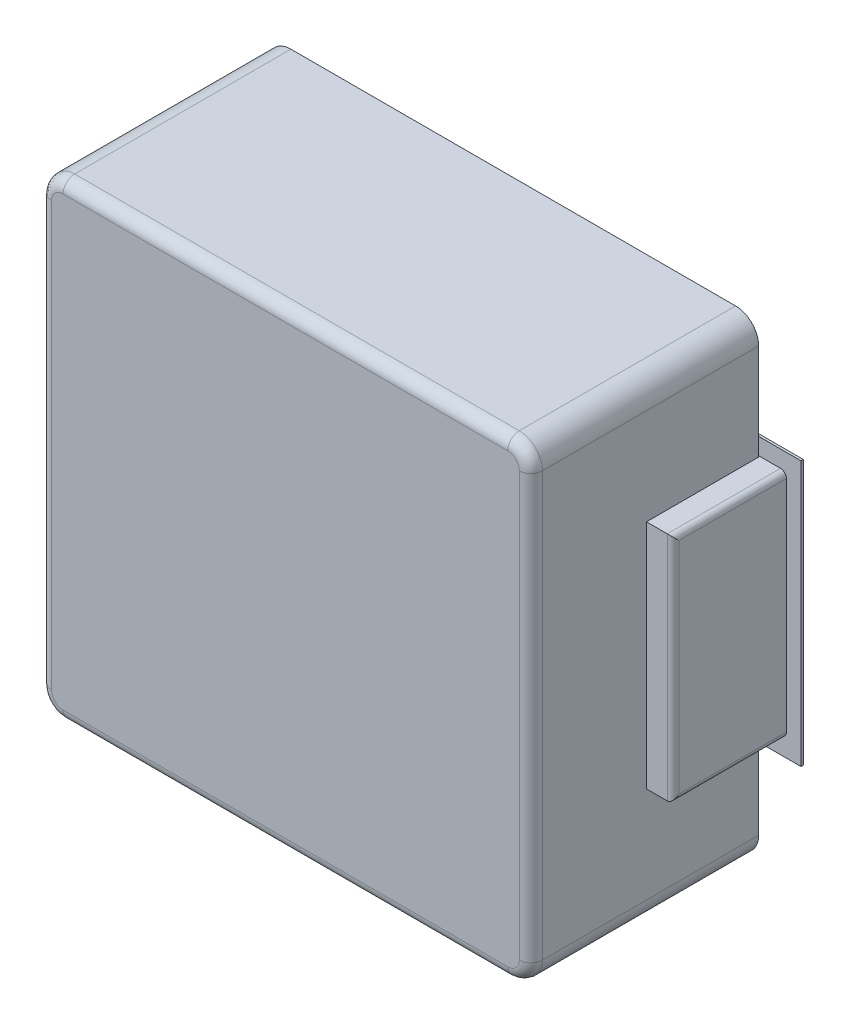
ISO-10303-21;
HEADER;
FILE_DESCRIPTION(('STEP AP214'),'2;1');
FILE_NAME('part.step','',(''),(''),'','','');
FILE_SCHEMA(('AUTOMOTIVE_DESIGN { 1 0 10303 214 1 1 1 1 }'));
ENDSEC;
DATA;
#1=APPLICATION_CONTEXT('core data for automotive mechanical design processes');
#2=APPLICATION_PROTOCOL_DEFINITION('international standard','automotive_design',2000,#1);
#3=PRODUCT_CONTEXT('',#1,'mechanical');
#4=PRODUCT('Part','Part','',(#3));
#5=PRODUCT_RELATED_PRODUCT_CATEGORY('part','',(#4));
#6=PRODUCT_DEFINITION_FORMATION('','',#4);
#7=PRODUCT_DEFINITION_CONTEXT('part definition',#1,'design');
#8=PRODUCT_DEFINITION('design','',#6,#7);
#9=PRODUCT_DEFINITION_SHAPE('','',#8);
#10=(LENGTH_UNIT() NAMED_UNIT(*) SI_UNIT(.MILLI.,.METRE.));
#11=(NAMED_UNIT(*) PLANE_ANGLE_UNIT() SI_UNIT($,.RADIAN.));
#12=(NAMED_UNIT(*) SI_UNIT($,.STERADIAN.) SOLID_ANGLE_UNIT());
#13=UNCERTAINTY_MEASURE_WITH_UNIT(LENGTH_MEASURE(1.E-05),#10,'distance_accuracy_value','');
#14=(GEOMETRIC_REPRESENTATION_CONTEXT(3) GLOBAL_UNCERTAINTY_ASSIGNED_CONTEXT((#13)) GLOBAL_UNIT_ASSIGNED_CONTEXT((#10,
#11,#12)) REPRESENTATION_CONTEXT('',''));
#15=CARTESIAN_POINT('',(0.,0.,0.));
#16=DIRECTION('',(0.,0.,1.));
#17=DIRECTION('',(1.,0.,0.));
#18=AXIS2_PLACEMENT_3D('',#15,#16,#17);
#19=CARTESIAN_POINT('',(0.,0.,0.0762));
#20=DIRECTION('',(0.,0.,1.));
#21=DIRECTION('',(1.,0.,0.));
#22=AXIS2_PLACEMENT_3D('',#19,#20,#21);
#23=PLANE('',#22);
#24=DIRECTION('',(1.,0.,0.));
#25=VECTOR('',#24,1.);
#26=CARTESIAN_POINT('',(-2.47799999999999,-1.14499999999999,0.0762));
#27=LINE('',#26,#25);
#28=CARTESIAN_POINT('',(-2.47799999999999,-1.14499999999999,0.0762));
#29=VERTEX_POINT('',#28);
#30=CARTESIAN_POINT('',(-1.07800000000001,-1.14499999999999,0.0762));
#31=VERTEX_POINT('',#30);
#32=EDGE_CURVE('E350',#29,#31,#27,.T.);
#33=ORIENTED_EDGE('',*,*,#32,.F.);
#34=DIRECTION('',(0.,1.,0.));
#35=VECTOR('',#34,1.);
#36=CARTESIAN_POINT('',(-2.47799999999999,1.14499999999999,0.0762));
#37=LINE('',#36,#35);
#38=CARTESIAN_POINT('',(-2.47799999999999,1.14499999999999,0.0762));
#39=VERTEX_POINT('',#38);
#40=EDGE_CURVE('E355',#39,#29,#37,.F.);
#41=ORIENTED_EDGE('',*,*,#40,.F.);
#42=DIRECTION('',(1.,0.,0.));
#43=VECTOR('',#42,1.);
#44=CARTESIAN_POINT('',(0.,1.14499999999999,0.0762));
#45=LINE('',#44,#43);
#46=CARTESIAN_POINT('',(-1.07800000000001,1.14499999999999,0.0762));
#47=VERTEX_POINT('',#46);
#48=EDGE_CURVE('E359',#47,#39,#45,.F.);
#49=ORIENTED_EDGE('',*,*,#48,.F.);
#50=DIRECTION('',(0.,1.,0.));
#51=VECTOR('',#50,1.);
#52=CARTESIAN_POINT('',(-1.07800000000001,-1.14499999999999,0.0762));
#53=LINE('',#52,#51);
#54=EDGE_CURVE('E344',#31,#47,#53,.T.);
#55=ORIENTED_EDGE('',*,*,#54,.F.);
#56=EDGE_LOOP('',(#33,#41,#49,#55));
#57=FACE_BOUND('',#56,.T.);
#58=ADVANCED_FACE('F16',(#57),#23,.F.);
#59=CARTESIAN_POINT('',(0.,0.,0.0762));
#60=DIRECTION('',(0.,0.,1.));
#61=DIRECTION('',(1.,0.,0.));
#62=AXIS2_PLACEMENT_3D('',#59,#60,#61);
#63=PLANE('',#62);
#64=DIRECTION('',(1.,0.,0.));
#65=VECTOR('',#64,1.);
#66=CARTESIAN_POINT('',(1.07800000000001,-1.14499999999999,0.0762));
#67=LINE('',#66,#65);
#68=CARTESIAN_POINT('',(1.07800000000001,-1.14499999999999,0.0762));
#69=VERTEX_POINT('',#68);
#70=CARTESIAN_POINT('',(2.47799999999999,-1.14499999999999,0.0762));
#71=VERTEX_POINT('',#70);
#72=EDGE_CURVE('E331',#69,#71,#67,.T.);
#73=ORIENTED_EDGE('',*,*,#72,.F.);
#74=DIRECTION('',(0.,1.,0.));
#75=VECTOR('',#74,1.);
#76=CARTESIAN_POINT('',(1.07800000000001,1.14499999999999,0.0762));
#77=LINE('',#76,#75);
#78=CARTESIAN_POINT('',(1.07800000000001,1.14499999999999,0.0762));
#79=VERTEX_POINT('',#78);
#80=EDGE_CURVE('E336',#79,#69,#77,.F.);
#81=ORIENTED_EDGE('',*,*,#80,.F.);
#82=DIRECTION('',(1.,0.,0.));
#83=VECTOR('',#82,1.);
#84=CARTESIAN_POINT('',(0.,1.14499999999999,0.0762));
#85=LINE('',#84,#83);
#86=CARTESIAN_POINT('',(2.47799999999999,1.14499999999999,0.0762));
#87=VERTEX_POINT('',#86);
#88=EDGE_CURVE('E357',#87,#79,#85,.F.);
#89=ORIENTED_EDGE('',*,*,#88,.F.);
#90=DIRECTION('',(0.,1.,0.));
#91=VECTOR('',#90,1.);
#92=CARTESIAN_POINT('',(2.47799999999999,-1.14499999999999,0.0762));
#93=LINE('',#92,#91);
#94=EDGE_CURVE('E325',#71,#87,#93,.T.);
#95=ORIENTED_EDGE('',*,*,#94,.F.);
#96=EDGE_LOOP('',(#73,#81,#89,#95));
#97=FACE_BOUND('',#96,.T.);
#98=ADVANCED_FACE('F927',(#97),#63,.F.);
#99=CARTESIAN_POINT('',(-2.47799999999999,1.14499999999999,0.0762));
#100=DIRECTION('',(-1.,0.,0.));
#101=DIRECTION('',(0.,0.,1.));
#102=AXIS2_PLACEMENT_3D('',#99,#100,#101);
#103=PLANE('',#102);
#104=DIRECTION('',(0.,0.,1.));
#105=VECTOR('',#104,1.);
#106=CARTESIAN_POINT('',(-2.47799999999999,1.14499999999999,0.0762));
#107=LINE('',#106,#105);
#108=CARTESIAN_POINT('',(-2.47799999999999,1.14499999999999,0.0961999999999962));
#109=VERTEX_POINT('',#108);
#110=EDGE_CURVE('E341',#39,#109,#107,.T.);
#111=ORIENTED_EDGE('',*,*,#110,.F.);
#112=ORIENTED_EDGE('',*,*,#40,.T.);
#113=DIRECTION('',(0.,0.,-1.));
#114=VECTOR('',#113,1.);
#115=CARTESIAN_POINT('',(-2.47799999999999,-1.14499999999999,0.0762));
#116=LINE('',#115,#114);
#117=CARTESIAN_POINT('',(-2.47799999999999,-1.14499999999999,0.0961999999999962));
#118=VERTEX_POINT('',#117);
#119=EDGE_CURVE('E352',#118,#29,#116,.T.);
#120=ORIENTED_EDGE('',*,*,#119,.F.);
#121=DIRECTION('',(0.,1.,0.));
#122=VECTOR('',#121,1.);
#123=CARTESIAN_POINT('',(-2.47799999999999,0.,0.0961999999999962));
#124=LINE('',#123,#122);
#125=EDGE_CURVE('E313',#109,#118,#124,.F.);
#126=ORIENTED_EDGE('',*,*,#125,.F.);
#127=EDGE_LOOP('',(#111,#112,#120,#126));
#128=FACE_BOUND('',#127,.T.);
#129=ADVANCED_FACE('F924',(#128),#103,.T.);
#130=CARTESIAN_POINT('',(-2.47799999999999,-1.14499999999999,0.0762));
#131=DIRECTION('',(0.,-1.,0.));
#132=DIRECTION('',(0.,0.,-1.));
#133=AXIS2_PLACEMENT_3D('',#130,#131,#132);
#134=PLANE('',#133);
#135=ORIENTED_EDGE('',*,*,#119,.T.);
#136=ORIENTED_EDGE('',*,*,#32,.T.);
#137=DIRECTION('',(0.,0.,-1.));
#138=VECTOR('',#137,1.);
#139=CARTESIAN_POINT('',(-1.07800000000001,-1.14499999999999,0.0762));
#140=LINE('',#139,#138);
#141=CARTESIAN_POINT('',(-1.07800000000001,-1.14499999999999,0.0961999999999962));
#142=VERTEX_POINT('',#141);
#143=EDGE_CURVE('E347',#142,#31,#140,.T.);
#144=ORIENTED_EDGE('',*,*,#143,.F.);
#145=DIRECTION('',(1.,0.,0.));
#146=VECTOR('',#145,1.);
#147=CARTESIAN_POINT('',(0.,-1.14499999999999,0.0961999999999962));
#148=LINE('',#147,#146);
#149=EDGE_CURVE('E310',#118,#142,#148,.T.);
#150=ORIENTED_EDGE('',*,*,#149,.F.);
#151=EDGE_LOOP('',(#135,#136,#144,#150));
#152=FACE_BOUND('',#151,.T.);
#153=ADVANCED_FACE('F920',(#152),#134,.T.);
#154=CARTESIAN_POINT('',(-1.07800000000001,-1.14499999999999,0.0762));
#155=DIRECTION('',(1.,0.,0.));
#156=DIRECTION('',(0.,0.,-1.));
#157=AXIS2_PLACEMENT_3D('',#154,#155,#156);
#158=PLANE('',#157);
#159=ORIENTED_EDGE('',*,*,#143,.T.);
#160=ORIENTED_EDGE('',*,*,#54,.T.);
#161=DIRECTION('',(0.,0.,1.));
#162=VECTOR('',#161,1.);
#163=CARTESIAN_POINT('',(-1.07800000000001,1.14499999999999,0.0762));
#164=LINE('',#163,#162);
#165=CARTESIAN_POINT('',(-1.07800000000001,1.14499999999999,0.0961999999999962));
#166=VERTEX_POINT('',#165);
#167=EDGE_CURVE('E338',#166,#47,#164,.F.);
#168=ORIENTED_EDGE('',*,*,#167,.F.);
#169=DIRECTION('',(0.,1.,0.));
#170=VECTOR('',#169,1.);
#171=CARTESIAN_POINT('',(-1.07800000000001,0.,0.0961999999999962));
#172=LINE('',#171,#170);
#173=EDGE_CURVE('E307',#142,#166,#172,.T.);
#174=ORIENTED_EDGE('',*,*,#173,.F.);
#175=EDGE_LOOP('',(#159,#160,#168,#174));
#176=FACE_BOUND('',#175,.T.);
#177=ADVANCED_FACE('F916',(#176),#158,.T.);
#178=CARTESIAN_POINT('',(-1.07800000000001,1.14499999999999,0.0762));
#179=DIRECTION('',(0.,1.,0.));
#180=DIRECTION('',(0.,0.,1.));
#181=AXIS2_PLACEMENT_3D('',#178,#179,#180);
#182=PLANE('',#181);
#183=ORIENTED_EDGE('',*,*,#167,.T.);
#184=ORIENTED_EDGE('',*,*,#48,.T.);
#185=ORIENTED_EDGE('',*,*,#110,.T.);
#186=DIRECTION('',(1.,0.,0.));
#187=VECTOR('',#186,1.);
#188=CARTESIAN_POINT('',(0.,1.14499999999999,0.0961999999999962));
#189=LINE('',#188,#187);
#190=EDGE_CURVE('E302',#166,#109,#189,.F.);
#191=ORIENTED_EDGE('',*,*,#190,.F.);
#192=EDGE_LOOP('',(#183,#184,#185,#191));
#193=FACE_BOUND('',#192,.T.);
#194=ADVANCED_FACE('F912',(#193),#182,.T.);
#195=CARTESIAN_POINT('',(1.07800000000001,1.14499999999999,0.0762));
#196=DIRECTION('',(-1.,0.,0.));
#197=DIRECTION('',(0.,0.,1.));
#198=AXIS2_PLACEMENT_3D('',#195,#196,#197);
#199=PLANE('',#198);
#200=DIRECTION('',(0.,0.,1.));
#201=VECTOR('',#200,1.);
#202=CARTESIAN_POINT('',(1.07800000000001,1.14499999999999,0.0762));
#203=LINE('',#202,#201);
#204=CARTESIAN_POINT('',(1.07800000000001,1.14499999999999,0.0961999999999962));
#205=VERTEX_POINT('',#204);
#206=EDGE_CURVE('E322',#79,#205,#203,.T.);
#207=ORIENTED_EDGE('',*,*,#206,.F.);
#208=ORIENTED_EDGE('',*,*,#80,.T.);
#209=DIRECTION('',(0.,0.,-1.));
#210=VECTOR('',#209,1.);
#211=CARTESIAN_POINT('',(1.07800000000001,-1.14499999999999,0.0762));
#212=LINE('',#211,#210);
#213=CARTESIAN_POINT('',(1.07800000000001,-1.14499999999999,0.0961999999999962));
#214=VERTEX_POINT('',#213);
#215=EDGE_CURVE('E333',#214,#69,#212,.T.);
#216=ORIENTED_EDGE('',*,*,#215,.F.);
#217=DIRECTION('',(0.,1.,0.));
#218=VECTOR('',#217,1.);
#219=CARTESIAN_POINT('',(1.07800000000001,0.,0.0961999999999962));
#220=LINE('',#219,#218);
#221=EDGE_CURVE('E290',#205,#214,#220,.F.);
#222=ORIENTED_EDGE('',*,*,#221,.F.);
#223=EDGE_LOOP('',(#207,#208,#216,#222));
#224=FACE_BOUND('',#223,.T.);
#225=ADVANCED_FACE('F908',(#224),#199,.T.);
#226=CARTESIAN_POINT('',(1.07800000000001,-1.14499999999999,0.0762));
#227=DIRECTION('',(0.,-1.,0.));
#228=DIRECTION('',(0.,0.,-1.));
#229=AXIS2_PLACEMENT_3D('',#226,#227,#228);
#230=PLANE('',#229);
#231=ORIENTED_EDGE('',*,*,#215,.T.);
#232=ORIENTED_EDGE('',*,*,#72,.T.);
#233=DIRECTION('',(0.,0.,-1.));
#234=VECTOR('',#233,1.);
#235=CARTESIAN_POINT('',(2.47799999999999,-1.14499999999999,0.0762));
#236=LINE('',#235,#234);
#237=CARTESIAN_POINT('',(2.47799999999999,-1.14499999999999,0.0961999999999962));
#238=VERTEX_POINT('',#237);
#239=EDGE_CURVE('E328',#238,#71,#236,.T.);
#240=ORIENTED_EDGE('',*,*,#239,.F.);
#241=DIRECTION('',(1.,0.,0.));
#242=VECTOR('',#241,1.);
#243=CARTESIAN_POINT('',(0.,-1.14499999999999,0.0961999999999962));
#244=LINE('',#243,#242);
#245=EDGE_CURVE('E287',#214,#238,#244,.T.);
#246=ORIENTED_EDGE('',*,*,#245,.F.);
#247=EDGE_LOOP('',(#231,#232,#240,#246));
#248=FACE_BOUND('',#247,.T.);
#249=ADVANCED_FACE('F904',(#248),#230,.T.);
#250=CARTESIAN_POINT('',(2.47799999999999,-1.14499999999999,0.0762));
#251=DIRECTION('',(1.,0.,0.));
#252=DIRECTION('',(0.,0.,-1.));
#253=AXIS2_PLACEMENT_3D('',#250,#251,#252);
#254=PLANE('',#253);
#255=ORIENTED_EDGE('',*,*,#239,.T.);
#256=ORIENTED_EDGE('',*,*,#94,.T.);
#257=DIRECTION('',(0.,0.,1.));
#258=VECTOR('',#257,1.);
#259=CARTESIAN_POINT('',(2.47799999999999,1.14499999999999,0.0762));
#260=LINE('',#259,#258);
#261=CARTESIAN_POINT('',(2.47799999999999,1.14499999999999,0.0961999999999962));
#262=VERTEX_POINT('',#261);
#263=EDGE_CURVE('E319',#262,#87,#260,.F.);
#264=ORIENTED_EDGE('',*,*,#263,.F.);
#265=DIRECTION('',(0.,1.,0.));
#266=VECTOR('',#265,1.);
#267=CARTESIAN_POINT('',(2.47799999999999,0.,0.0961999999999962));
#268=LINE('',#267,#266);
#269=EDGE_CURVE('E284',#238,#262,#268,.T.);
#270=ORIENTED_EDGE('',*,*,#269,.F.);
#271=EDGE_LOOP('',(#255,#256,#264,#270));
#272=FACE_BOUND('',#271,.T.);
#273=ADVANCED_FACE('F900',(#272),#254,.T.);
#274=CARTESIAN_POINT('',(2.47799999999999,1.14499999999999,0.0762));
#275=DIRECTION('',(0.,1.,0.));
#276=DIRECTION('',(0.,0.,1.));
#277=AXIS2_PLACEMENT_3D('',#274,#275,#276);
#278=PLANE('',#277);
#279=ORIENTED_EDGE('',*,*,#263,.T.);
#280=ORIENTED_EDGE('',*,*,#88,.T.);
#281=ORIENTED_EDGE('',*,*,#206,.T.);
#282=DIRECTION('',(1.,0.,0.));
#283=VECTOR('',#282,1.);
#284=CARTESIAN_POINT('',(0.,1.14499999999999,0.0961999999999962));
#285=LINE('',#284,#283);
#286=EDGE_CURVE('E257',#262,#205,#285,.F.);
#287=ORIENTED_EDGE('',*,*,#286,.F.);
#288=EDGE_LOOP('',(#279,#280,#281,#287));
#289=FACE_BOUND('',#288,.T.);
#290=ADVANCED_FACE('F897',(#289),#278,.T.);
#291=CARTESIAN_POINT('',(2.35199999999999,-1.00000000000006,0.0762));
#292=DIRECTION('',(1.,0.,0.));
#293=DIRECTION('',(0.,0.,-1.));
#294=AXIS2_PLACEMENT_3D('',#291,#292,#293);
#295=PLANE('',#294);
#296=DIRECTION('',(0.,0.,-1.));
#297=VECTOR('',#296,1.);
#298=CARTESIAN_POINT('',(2.35199999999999,-0.95000000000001,0.0762));
#299=LINE('',#298,#297);
#300=CARTESIAN_POINT('',(2.35199999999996,-0.95000000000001,1.02620000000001));
#301=VERTEX_POINT('',#300);
#302=CARTESIAN_POINT('',(2.35199999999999,-0.95000000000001,0.0961999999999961));
#303=VERTEX_POINT('',#302);
#304=EDGE_CURVE('E252',#301,#303,#299,.T.);
#305=ORIENTED_EDGE('',*,*,#304,.T.);
#306=DIRECTION('',(0.,1.,0.));
#307=VECTOR('',#306,1.);
#308=CARTESIAN_POINT('',(2.35199999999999,0.,0.0961999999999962));
#309=LINE('',#308,#307);
#310=CARTESIAN_POINT('',(2.35199999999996,0.95000000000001,0.0961999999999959));
#311=VERTEX_POINT('',#310);
#312=EDGE_CURVE('E245',#311,#303,#309,.F.);
#313=ORIENTED_EDGE('',*,*,#312,.F.);
#314=DIRECTION('',(0.,0.,-1.));
#315=VECTOR('',#314,1.);
#316=CARTESIAN_POINT('',(2.35199999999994,0.95000000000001,4.6833907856));
#317=LINE('',#316,#315);
#318=CARTESIAN_POINT('',(2.35199999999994,0.95000000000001,1.02620000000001));
#319=VERTEX_POINT('',#318);
#320=EDGE_CURVE('E250',#319,#311,#317,.T.);
#321=ORIENTED_EDGE('',*,*,#320,.F.);
#322=DIRECTION('',(0.,1.,0.));
#323=VECTOR('',#322,1.);
#324=CARTESIAN_POINT('',(2.35199999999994,-7.7879448,1.02620000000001));
#325=LINE('',#324,#323);
#326=EDGE_CURVE('E405',#301,#319,#325,.T.);
#327=ORIENTED_EDGE('',*,*,#326,.F.);
#328=EDGE_LOOP('',(#305,#313,#321,#327));
#329=FACE_BOUND('',#328,.T.);
#330=ADVANCED_FACE('F247',(#329),#295,.T.);
#331=CARTESIAN_POINT('',(-2.35199999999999,1.00000000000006,0.0762));
#332=DIRECTION('',(-1.,0.,0.));
#333=DIRECTION('',(0.,0.,1.));
#334=AXIS2_PLACEMENT_3D('',#331,#332,#333);
#335=PLANE('',#334);
#336=DIRECTION('',(0.,0.,1.));
#337=VECTOR('',#336,1.);
#338=CARTESIAN_POINT('',(-2.35199999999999,0.95000000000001,0.0762));
#339=LINE('',#338,#337);
#340=CARTESIAN_POINT('',(-2.35199999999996,0.95000000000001,1.02620000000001));
#341=VERTEX_POINT('',#340);
#342=CARTESIAN_POINT('',(-2.35199999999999,0.95000000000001,0.0961999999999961));
#343=VERTEX_POINT('',#342);
#344=EDGE_CURVE('E316',#341,#343,#339,.F.);
#345=ORIENTED_EDGE('',*,*,#344,.T.);
#346=DIRECTION('',(0.,1.,0.));
#347=VECTOR('',#346,1.);
#348=CARTESIAN_POINT('',(-2.35199999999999,0.,0.0961999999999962));
#349=LINE('',#348,#347);
#350=CARTESIAN_POINT('',(-2.35199999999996,-0.95000000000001,0.0961999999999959));
#351=VERTEX_POINT('',#350);
#352=EDGE_CURVE('E293',#351,#343,#349,.T.);
#353=ORIENTED_EDGE('',*,*,#352,.F.);
#354=DIRECTION('',(0.,0.,-1.));
#355=VECTOR('',#354,1.);
#356=CARTESIAN_POINT('',(-2.35199999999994,-0.95000000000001,4.6833907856));
#357=LINE('',#356,#355);
#358=CARTESIAN_POINT('',(-2.35199999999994,-0.95000000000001,1.02620000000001));
#359=VERTEX_POINT('',#358);
#360=EDGE_CURVE('E400',#359,#351,#357,.T.);
#361=ORIENTED_EDGE('',*,*,#360,.F.);
#362=DIRECTION('',(0.,-1.,0.));
#363=VECTOR('',#362,1.);
#364=CARTESIAN_POINT('',(-2.35199999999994,7.7879448,1.02620000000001));
#365=LINE('',#364,#363);
#366=EDGE_CURVE('E393',#341,#359,#365,.T.);
#367=ORIENTED_EDGE('',*,*,#366,.F.);
#368=EDGE_LOOP('',(#345,#353,#361,#367));
#369=FACE_BOUND('',#368,.T.);
#370=ADVANCED_FACE('F890',(#369),#335,.T.);
#371=CARTESIAN_POINT('',(0.,0.,0.0961999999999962));
#372=DIRECTION('',(0.,0.,1.));
#373=DIRECTION('',(1.,0.,0.));
#374=AXIS2_PLACEMENT_3D('',#371,#372,#373);
#375=PLANE('',#374);
#376=CARTESIAN_POINT('',(-2.30199999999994,-0.95000000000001,0.0961999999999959));
#377=DIRECTION('',(0.,0.,-1.));
#378=DIRECTION('',(-1.,0.,0.));
#379=AXIS2_PLACEMENT_3D('',#376,#377,#378);
#380=CIRCLE('',#379,0.0500000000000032);
#381=CARTESIAN_POINT('',(-2.30199999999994,-1.00000000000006,0.0961999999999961));
#382=VERTEX_POINT('',#381);
#383=EDGE_CURVE('E397',#351,#382,#380,.F.);
#384=ORIENTED_EDGE('',*,*,#383,.F.);
#385=ORIENTED_EDGE('',*,*,#352,.T.);
#386=CARTESIAN_POINT('',(-2.30199999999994,0.95000000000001,0.0961999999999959));
#387=DIRECTION('',(0.,0.,-1.));
#388=DIRECTION('',(-1.,0.,0.));
#389=AXIS2_PLACEMENT_3D('',#386,#387,#388);
#390=CIRCLE('',#389,0.0500000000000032);
#391=CARTESIAN_POINT('',(-2.30199999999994,1.00000000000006,0.0961999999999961));
#392=VERTEX_POINT('',#391);
#393=EDGE_CURVE('E386',#392,#343,#390,.F.);
#394=ORIENTED_EDGE('',*,*,#393,.F.);
#395=DIRECTION('',(1.,0.,0.));
#396=VECTOR('',#395,1.);
#397=CARTESIAN_POINT('',(0.,1.00000000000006,0.0961999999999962));
#398=LINE('',#397,#396);
#399=CARTESIAN_POINT('',(-1.59199999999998,1.00000000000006,0.0961999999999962));
#400=VERTEX_POINT('',#399);
#401=EDGE_CURVE('E298',#392,#400,#398,.T.);
#402=ORIENTED_EDGE('',*,*,#401,.T.);
#403=DIRECTION('',(0.,1.,0.));
#404=VECTOR('',#403,1.);
#405=CARTESIAN_POINT('',(-1.59199999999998,-1.00000000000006,0.0961999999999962));
#406=LINE('',#405,#404);
#407=CARTESIAN_POINT('',(-1.59199999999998,-1.00000000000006,0.0961999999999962));
#408=VERTEX_POINT('',#407);
#409=EDGE_CURVE('E389',#408,#400,#406,.T.);
#410=ORIENTED_EDGE('',*,*,#409,.F.);
#411=DIRECTION('',(1.,0.,0.));
#412=VECTOR('',#411,1.);
#413=CARTESIAN_POINT('',(0.,-1.00000000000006,0.0961999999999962));
#414=LINE('',#413,#412);
#415=EDGE_CURVE('E296',#408,#382,#414,.F.);
#416=ORIENTED_EDGE('',*,*,#415,.T.);
#417=EDGE_LOOP('',(#384,#385,#394,#402,#410,#416));
#418=FACE_BOUND('',#417,.T.);
#419=ORIENTED_EDGE('',*,*,#173,.T.);
#420=ORIENTED_EDGE('',*,*,#190,.T.);
#421=ORIENTED_EDGE('',*,*,#125,.T.);
#422=ORIENTED_EDGE('',*,*,#149,.T.);
#423=EDGE_LOOP('',(#419,#420,#421,#422));
#424=FACE_BOUND('',#423,.T.);
#425=ADVANCED_FACE('F887',(#418,#424),#375,.T.);
#426=CARTESIAN_POINT('',(0.,0.,0.0961999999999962));
#427=DIRECTION('',(0.,0.,1.));
#428=DIRECTION('',(1.,0.,0.));
#429=AXIS2_PLACEMENT_3D('',#426,#427,#428);
#430=PLANE('',#429);
#431=DIRECTION('',(0.,1.,0.));
#432=VECTOR('',#431,1.);
#433=CARTESIAN_POINT('',(1.59199999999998,1.00000000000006,0.0961999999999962));
#434=LINE('',#433,#432);
#435=CARTESIAN_POINT('',(1.59199999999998,1.00000000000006,0.0961999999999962));
#436=VERTEX_POINT('',#435);
#437=CARTESIAN_POINT('',(1.59199999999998,-1.00000000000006,0.0961999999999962));
#438=VERTEX_POINT('',#437);
#439=EDGE_CURVE('E419',#436,#438,#434,.F.);
#440=ORIENTED_EDGE('',*,*,#439,.F.);
#441=DIRECTION('',(1.,0.,0.));
#442=VECTOR('',#441,1.);
#443=CARTESIAN_POINT('',(0.,1.00000000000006,0.0961999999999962));
#444=LINE('',#443,#442);
#445=CARTESIAN_POINT('',(2.30199999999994,1.00000000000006,0.0961999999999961));
#446=VERTEX_POINT('',#445);
#447=EDGE_CURVE('E264',#436,#446,#444,.T.);
#448=ORIENTED_EDGE('',*,*,#447,.T.);
#449=CARTESIAN_POINT('',(2.30199999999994,0.95000000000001,0.0961999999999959));
#450=DIRECTION('',(0.,0.,-1.));
#451=DIRECTION('',(-1.,0.,0.));
#452=AXIS2_PLACEMENT_3D('',#449,#450,#451);
#453=CIRCLE('',#452,0.0500000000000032);
#454=EDGE_CURVE('E19',#311,#446,#453,.F.);
#455=ORIENTED_EDGE('',*,*,#454,.F.);
#456=ORIENTED_EDGE('',*,*,#312,.T.);
#457=CARTESIAN_POINT('',(2.30199999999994,-0.95000000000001,0.0961999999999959));
#458=DIRECTION('',(0.,0.,-1.));
#459=DIRECTION('',(-1.,0.,0.));
#460=AXIS2_PLACEMENT_3D('',#457,#458,#459);
#461=CIRCLE('',#460,0.0500000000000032);
#462=CARTESIAN_POINT('',(2.30199999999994,-1.00000000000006,0.0961999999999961));
#463=VERTEX_POINT('',#462);
#464=EDGE_CURVE('E401',#463,#303,#461,.F.);
#465=ORIENTED_EDGE('',*,*,#464,.F.);
#466=DIRECTION('',(1.,0.,0.));
#467=VECTOR('',#466,1.);
#468=CARTESIAN_POINT('',(0.,-1.00000000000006,0.0961999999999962));
#469=LINE('',#468,#467);
#470=EDGE_CURVE('E256',#463,#438,#469,.F.);
#471=ORIENTED_EDGE('',*,*,#470,.T.);
#472=EDGE_LOOP('',(#440,#448,#455,#456,#465,#471));
#473=FACE_BOUND('',#472,.T.);
#474=ORIENTED_EDGE('',*,*,#269,.T.);
#475=ORIENTED_EDGE('',*,*,#286,.T.);
#476=ORIENTED_EDGE('',*,*,#221,.T.);
#477=ORIENTED_EDGE('',*,*,#245,.T.);
#478=EDGE_LOOP('',(#474,#475,#476,#477));
#479=FACE_BOUND('',#478,.T.);
#480=ADVANCED_FACE('F262',(#473,#479),#430,.T.);
#481=CARTESIAN_POINT('',(2.30199999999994,0.95000000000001,4.6833907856));
#482=DIRECTION('',(0.,0.,-1.));
#483=DIRECTION('',(-1.,0.,0.));
#484=AXIS2_PLACEMENT_3D('',#481,#482,#483);
#485=CYLINDRICAL_SURFACE('',#484,0.0500000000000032);
#486=ORIENTED_EDGE('',*,*,#320,.T.);
#487=ORIENTED_EDGE('',*,*,#454,.T.);
#488=DIRECTION('',(0.,0.,1.));
#489=VECTOR('',#488,1.);
#490=CARTESIAN_POINT('',(2.30199999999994,1.00000000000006,0.0762));
#491=LINE('',#490,#489);
#492=CARTESIAN_POINT('',(2.30199999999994,1.00000000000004,1.07620000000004));
#493=VERTEX_POINT('',#492);
#494=EDGE_CURVE('E274',#493,#446,#491,.F.);
#495=ORIENTED_EDGE('',*,*,#494,.F.);
#496=CARTESIAN_POINT('',(2.30199999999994,0.950000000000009,1.02620000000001));
#497=DIRECTION('',(0.,0.707106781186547,-0.707106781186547));
#498=DIRECTION('',(0.,0.707106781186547,0.707106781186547));
#499=AXIS2_PLACEMENT_3D('',#496,#497,#498);
#500=ELLIPSE('',#499,0.0707106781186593,0.0500000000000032);
#501=EDGE_CURVE('E267',#319,#493,#500,.F.);
#502=ORIENTED_EDGE('',*,*,#501,.F.);
#503=EDGE_LOOP('',(#486,#487,#495,#502));
#504=FACE_BOUND('',#503,.T.);
#505=ADVANCED_FACE('F268',(#504),#485,.T.);
#506=CARTESIAN_POINT('',(2.30199999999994,-7.7879448,1.02620000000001));
#507=DIRECTION('',(0.,1.,0.));
#508=DIRECTION('',(0.,0.,1.));
#509=AXIS2_PLACEMENT_3D('',#506,#507,#508);
#510=CYLINDRICAL_SURFACE('',#509,0.0500000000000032);
#511=CARTESIAN_POINT('',(2.30199999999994,-0.95000000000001,1.02620000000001));
#512=DIRECTION('',(0.,-0.707106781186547,-0.707106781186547));
#513=DIRECTION('',(0.,0.707106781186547,-0.707106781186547));
#514=AXIS2_PLACEMENT_3D('',#511,#512,#513);
#515=ELLIPSE('',#514,0.0707106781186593,0.0500000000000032);
#516=CARTESIAN_POINT('',(2.30199999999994,-1.00000000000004,1.07620000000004));
#517=VERTEX_POINT('',#516);
#518=EDGE_CURVE('E403',#301,#517,#515,.T.);
#519=ORIENTED_EDGE('',*,*,#518,.F.);
#520=ORIENTED_EDGE('',*,*,#326,.T.);
#521=ORIENTED_EDGE('',*,*,#501,.T.);
#522=DIRECTION('',(0.,1.,0.));
#523=VECTOR('',#522,1.);
#524=CARTESIAN_POINT('',(2.30199999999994,0.,1.07620000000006));
#525=LINE('',#524,#523);
#526=EDGE_CURVE('E414',#517,#493,#525,.T.);
#527=ORIENTED_EDGE('',*,*,#526,.F.);
#528=EDGE_LOOP('',(#519,#520,#521,#527));
#529=FACE_BOUND('',#528,.T.);
#530=ADVANCED_FACE('F879',(#529),#510,.T.);
#531=CARTESIAN_POINT('',(2.30199999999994,-0.95000000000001,4.6833907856));
#532=DIRECTION('',(0.,0.,-1.));
#533=DIRECTION('',(-1.,0.,0.));
#534=AXIS2_PLACEMENT_3D('',#531,#532,#533);
#535=CYLINDRICAL_SURFACE('',#534,0.0500000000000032);
#536=DIRECTION('',(0.,0.,-1.));
#537=VECTOR('',#536,1.);
#538=CARTESIAN_POINT('',(2.30199999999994,-1.00000000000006,0.0762));
#539=LINE('',#538,#537);
#540=EDGE_CURVE('E410',#463,#517,#539,.F.);
#541=ORIENTED_EDGE('',*,*,#540,.F.);
#542=ORIENTED_EDGE('',*,*,#464,.T.);
#543=ORIENTED_EDGE('',*,*,#304,.F.);
#544=ORIENTED_EDGE('',*,*,#518,.T.);
#545=EDGE_LOOP('',(#541,#542,#543,#544));
#546=FACE_BOUND('',#545,.T.);
#547=ADVANCED_FACE('F875',(#546),#535,.T.);
#548=CARTESIAN_POINT('',(-2.30199999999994,-0.95000000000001,4.6833907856));
#549=DIRECTION('',(0.,0.,-1.));
#550=DIRECTION('',(-1.,0.,0.));
#551=AXIS2_PLACEMENT_3D('',#548,#549,#550);
#552=CYLINDRICAL_SURFACE('',#551,0.0500000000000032);
#553=ORIENTED_EDGE('',*,*,#360,.T.);
#554=ORIENTED_EDGE('',*,*,#383,.T.);
#555=DIRECTION('',(0.,0.,-1.));
#556=VECTOR('',#555,1.);
#557=CARTESIAN_POINT('',(-2.30199999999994,-1.00000000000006,0.0762));
#558=LINE('',#557,#556);
#559=CARTESIAN_POINT('',(-2.30199999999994,-1.00000000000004,1.07620000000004));
#560=VERTEX_POINT('',#559);
#561=EDGE_CURVE('E425',#560,#382,#558,.T.);
#562=ORIENTED_EDGE('',*,*,#561,.F.);
#563=CARTESIAN_POINT('',(-2.30199999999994,-0.950000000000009,1.02620000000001));
#564=DIRECTION('',(0.,-0.707106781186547,-0.707106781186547));
#565=DIRECTION('',(0.,-0.707106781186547,0.707106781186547));
#566=AXIS2_PLACEMENT_3D('',#563,#564,#565);
#567=ELLIPSE('',#566,0.0707106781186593,0.0500000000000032);
#568=EDGE_CURVE('E394',#359,#560,#567,.F.);
#569=ORIENTED_EDGE('',*,*,#568,.F.);
#570=EDGE_LOOP('',(#553,#554,#562,#569));
#571=FACE_BOUND('',#570,.T.);
#572=ADVANCED_FACE('F871',(#571),#552,.T.);
#573=CARTESIAN_POINT('',(-2.30199999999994,7.7879448,1.02620000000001));
#574=DIRECTION('',(0.,-1.,0.));
#575=DIRECTION('',(0.,0.,-1.));
#576=AXIS2_PLACEMENT_3D('',#573,#574,#575);
#577=CYLINDRICAL_SURFACE('',#576,0.0500000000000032);
#578=CARTESIAN_POINT('',(-2.30199999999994,0.95000000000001,1.02620000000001));
#579=DIRECTION('',(0.,0.707106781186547,-0.707106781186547));
#580=DIRECTION('',(0.,-0.707106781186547,-0.707106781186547));
#581=AXIS2_PLACEMENT_3D('',#578,#579,#580);
#582=ELLIPSE('',#581,0.0707106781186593,0.0500000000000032);
#583=CARTESIAN_POINT('',(-2.30199999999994,1.00000000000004,1.07620000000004));
#584=VERTEX_POINT('',#583);
#585=EDGE_CURVE('E390',#341,#584,#582,.T.);
#586=ORIENTED_EDGE('',*,*,#585,.F.);
#587=ORIENTED_EDGE('',*,*,#366,.T.);
#588=ORIENTED_EDGE('',*,*,#568,.T.);
#589=DIRECTION('',(0.,1.,0.));
#590=VECTOR('',#589,1.);
#591=CARTESIAN_POINT('',(-2.30199999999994,0.,1.07620000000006));
#592=LINE('',#591,#590);
#593=EDGE_CURVE('E436',#584,#560,#592,.F.);
#594=ORIENTED_EDGE('',*,*,#593,.F.);
#595=EDGE_LOOP('',(#586,#587,#588,#594));
#596=FACE_BOUND('',#595,.T.);
#597=ADVANCED_FACE('F867',(#596),#577,.T.);
#598=CARTESIAN_POINT('',(-2.30199999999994,0.95000000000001,4.6833907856));
#599=DIRECTION('',(0.,0.,-1.));
#600=DIRECTION('',(-1.,0.,0.));
#601=AXIS2_PLACEMENT_3D('',#598,#599,#600);
#602=CYLINDRICAL_SURFACE('',#601,0.0500000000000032);
#603=DIRECTION('',(0.,0.,1.));
#604=VECTOR('',#603,1.);
#605=CARTESIAN_POINT('',(-2.30199999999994,1.00000000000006,0.0762));
#606=LINE('',#605,#604);
#607=EDGE_CURVE('E432',#392,#584,#606,.T.);
#608=ORIENTED_EDGE('',*,*,#607,.F.);
#609=ORIENTED_EDGE('',*,*,#393,.T.);
#610=ORIENTED_EDGE('',*,*,#344,.F.);
#611=ORIENTED_EDGE('',*,*,#585,.T.);
#612=EDGE_LOOP('',(#608,#609,#610,#611));
#613=FACE_BOUND('',#612,.T.);
#614=ADVANCED_FACE('F863',(#613),#602,.T.);
#615=CARTESIAN_POINT('',(-1.59199999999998,-1.00000000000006,0.0762));
#616=DIRECTION('',(1.,0.,0.));
#617=DIRECTION('',(0.,0.,-1.));
#618=AXIS2_PLACEMENT_3D('',#615,#616,#617);
#619=PLANE('',#618);
#620=DIRECTION('',(0.,0.,-1.));
#621=VECTOR('',#620,1.);
#622=CARTESIAN_POINT('',(-1.59199999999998,-1.00000000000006,0.0762));
#623=LINE('',#622,#621);
#624=CARTESIAN_POINT('',(-1.59199999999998,-1.00000000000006,0.106200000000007));
#625=VERTEX_POINT('',#624);
#626=EDGE_CURVE('E429',#408,#625,#623,.F.);
#627=ORIENTED_EDGE('',*,*,#626,.F.);
#628=ORIENTED_EDGE('',*,*,#409,.T.);
#629=DIRECTION('',(0.,0.,1.));
#630=VECTOR('',#629,1.);
#631=CARTESIAN_POINT('',(-1.59199999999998,1.00000000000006,0.0762));
#632=LINE('',#631,#630);
#633=CARTESIAN_POINT('',(-1.59199999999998,1.00000000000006,0.106200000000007));
#634=VERTEX_POINT('',#633);
#635=EDGE_CURVE('E455',#634,#400,#632,.F.);
#636=ORIENTED_EDGE('',*,*,#635,.F.);
#637=DIRECTION('',(0.,1.,0.));
#638=VECTOR('',#637,1.);
#639=CARTESIAN_POINT('',(-1.59199999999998,0.,0.106200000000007));
#640=LINE('',#639,#638);
#641=EDGE_CURVE('E449',#625,#634,#640,.T.);
#642=ORIENTED_EDGE('',*,*,#641,.F.);
#643=EDGE_LOOP('',(#627,#628,#636,#642));
#644=FACE_BOUND('',#643,.T.);
#645=ADVANCED_FACE('F859',(#644),#619,.T.);
#646=CARTESIAN_POINT('',(1.59199999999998,1.00000000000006,0.0762));
#647=DIRECTION('',(-1.,0.,0.));
#648=DIRECTION('',(0.,0.,1.));
#649=AXIS2_PLACEMENT_3D('',#646,#647,#648);
#650=PLANE('',#649);
#651=DIRECTION('',(0.,0.,1.));
#652=VECTOR('',#651,1.);
#653=CARTESIAN_POINT('',(1.59199999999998,1.00000000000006,0.0762));
#654=LINE('',#653,#652);
#655=CARTESIAN_POINT('',(1.59199999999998,1.00000000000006,0.106200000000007));
#656=VERTEX_POINT('',#655);
#657=EDGE_CURVE('E422',#436,#656,#654,.T.);
#658=ORIENTED_EDGE('',*,*,#657,.F.);
#659=ORIENTED_EDGE('',*,*,#439,.T.);
#660=DIRECTION('',(0.,0.,-1.));
#661=VECTOR('',#660,1.);
#662=CARTESIAN_POINT('',(1.59199999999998,-1.00000000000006,0.0762));
#663=LINE('',#662,#661);
#664=CARTESIAN_POINT('',(1.59199999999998,-1.00000000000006,0.106200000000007));
#665=VERTEX_POINT('',#664);
#666=EDGE_CURVE('E469',#665,#438,#663,.T.);
#667=ORIENTED_EDGE('',*,*,#666,.F.);
#668=DIRECTION('',(0.,1.,0.));
#669=VECTOR('',#668,1.);
#670=CARTESIAN_POINT('',(1.59199999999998,0.,0.106200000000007));
#671=LINE('',#670,#669);
#672=EDGE_CURVE('E464',#656,#665,#671,.F.);
#673=ORIENTED_EDGE('',*,*,#672,.F.);
#674=EDGE_LOOP('',(#658,#659,#667,#673));
#675=FACE_BOUND('',#674,.T.);
#676=ADVANCED_FACE('F856',(#675),#650,.T.);
#677=CARTESIAN_POINT('',(2.35199999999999,1.00000000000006,0.0762));
#678=DIRECTION('',(0.,1.,0.));
#679=DIRECTION('',(0.,0.,1.));
#680=AXIS2_PLACEMENT_3D('',#677,#678,#679);
#681=PLANE('',#680);
#682=ORIENTED_EDGE('',*,*,#494,.T.);
#683=ORIENTED_EDGE('',*,*,#447,.F.);
#684=ORIENTED_EDGE('',*,*,#657,.T.);
#685=DIRECTION('',(-1.,0.,0.));
#686=VECTOR('',#685,1.);
#687=CARTESIAN_POINT('',(0.,1.00000000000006,0.106200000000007));
#688=LINE('',#687,#686);
#689=CARTESIAN_POINT('',(2.12249999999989,1.00000000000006,0.106200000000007));
#690=VERTEX_POINT('',#689);
#691=EDGE_CURVE('E382',#690,#656,#688,.T.);
#692=ORIENTED_EDGE('',*,*,#691,.F.);
#693=DIRECTION('',(0.,0.,1.));
#694=VECTOR('',#693,1.);
#695=CARTESIAN_POINT('',(2.12249999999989,1.00000000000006,2.076196));
#696=LINE('',#695,#694);
#697=CARTESIAN_POINT('',(2.12249999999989,1.00000000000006,1.07620000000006));
#698=VERTEX_POINT('',#697);
#699=EDGE_CURVE('E481',#690,#698,#696,.T.);
#700=ORIENTED_EDGE('',*,*,#699,.T.);
#701=DIRECTION('',(1.,0.,0.));
#702=VECTOR('',#701,1.);
#703=CARTESIAN_POINT('',(0.,1.00000000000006,1.07620000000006));
#704=LINE('',#703,#702);
#705=EDGE_CURVE('E416',#493,#698,#704,.F.);
#706=ORIENTED_EDGE('',*,*,#705,.F.);
#707=EDGE_LOOP('',(#682,#683,#684,#692,#700,#706));
#708=FACE_BOUND('',#707,.T.);
#709=ADVANCED_FACE('F835',(#708),#681,.T.);
#710=CARTESIAN_POINT('',(0.,0.,1.07620000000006));
#711=DIRECTION('',(0.,0.,1.));
#712=DIRECTION('',(1.,0.,0.));
#713=AXIS2_PLACEMENT_3D('',#710,#711,#712);
#714=PLANE('',#713);
#715=DIRECTION('',(1.,0.,0.));
#716=VECTOR('',#715,1.);
#717=CARTESIAN_POINT('',(1.59199999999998,-1.00000000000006,1.07620000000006));
#718=LINE('',#717,#716);
#719=CARTESIAN_POINT('',(2.12249999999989,-1.00000000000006,1.07620000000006));
#720=VERTEX_POINT('',#719);
#721=EDGE_CURVE('E413',#517,#720,#718,.F.);
#722=ORIENTED_EDGE('',*,*,#721,.F.);
#723=ORIENTED_EDGE('',*,*,#526,.T.);
#724=ORIENTED_EDGE('',*,*,#705,.T.);
#725=DIRECTION('',(0.,1.,0.));
#726=VECTOR('',#725,1.);
#727=CARTESIAN_POINT('',(2.12249999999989,2.032,1.07620000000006));
#728=LINE('',#727,#726);
#729=EDGE_CURVE('E485',#698,#720,#728,.F.);
#730=ORIENTED_EDGE('',*,*,#729,.T.);
#731=EDGE_LOOP('',(#722,#723,#724,#730));
#732=FACE_BOUND('',#731,.T.);
#733=ADVANCED_FACE('F832',(#732),#714,.T.);
#734=CARTESIAN_POINT('',(1.59199999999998,-1.00000000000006,0.0762));
#735=DIRECTION('',(0.,-1.,0.));
#736=DIRECTION('',(0.,0.,-1.));
#737=AXIS2_PLACEMENT_3D('',#734,#735,#736);
#738=PLANE('',#737);
#739=ORIENTED_EDGE('',*,*,#666,.T.);
#740=ORIENTED_EDGE('',*,*,#470,.F.);
#741=ORIENTED_EDGE('',*,*,#540,.T.);
#742=ORIENTED_EDGE('',*,*,#721,.T.);
#743=DIRECTION('',(0.,0.,1.));
#744=VECTOR('',#743,1.);
#745=CARTESIAN_POINT('',(2.12249999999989,-1.00000000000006,2.076196));
#746=LINE('',#745,#744);
#747=CARTESIAN_POINT('',(2.12249999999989,-1.00000000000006,0.106200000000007));
#748=VERTEX_POINT('',#747);
#749=EDGE_CURVE('E493',#720,#748,#746,.F.);
#750=ORIENTED_EDGE('',*,*,#749,.T.);
#751=DIRECTION('',(-1.,0.,0.));
#752=VECTOR('',#751,1.);
#753=CARTESIAN_POINT('',(0.,-1.00000000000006,0.106200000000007));
#754=LINE('',#753,#752);
#755=EDGE_CURVE('E378',#665,#748,#754,.F.);
#756=ORIENTED_EDGE('',*,*,#755,.F.);
#757=EDGE_LOOP('',(#739,#740,#741,#742,#750,#756));
#758=FACE_BOUND('',#757,.T.);
#759=ADVANCED_FACE('F828',(#758),#738,.T.);
#760=CARTESIAN_POINT('',(1.92249999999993,1.83200000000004,4.6833907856));
#761=DIRECTION('',(0.,0.,-1.));
#762=DIRECTION('',(-1.,0.,0.));
#763=AXIS2_PLACEMENT_3D('',#760,#761,#762);
#764=CYLINDRICAL_SURFACE('',#763,0.199999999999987);
#765=DIRECTION('',(0.,0.,1.));
#766=VECTOR('',#765,1.);
#767=CARTESIAN_POINT('',(2.12249999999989,1.83199999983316,2.076196));
#768=LINE('',#767,#766);
#769=CARTESIAN_POINT('',(2.12249999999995,1.8319999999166,1.97619599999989));
#770=VERTEX_POINT('',#769);
#771=CARTESIAN_POINT('',(2.12249999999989,1.8319999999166,0.106200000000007));
#772=VERTEX_POINT('',#771);
#773=EDGE_CURVE('E373',#770,#772,#768,.F.);
#774=ORIENTED_EDGE('',*,*,#773,.T.);
#775=CARTESIAN_POINT('',(1.92249999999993,1.83200000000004,0.106200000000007));
#776=DIRECTION('',(0.,0.,-1.));
#777=DIRECTION('',(-1.,0.,0.));
#778=AXIS2_PLACEMENT_3D('',#775,#776,#777);
#779=CIRCLE('',#778,0.199999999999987);
#780=CARTESIAN_POINT('',(1.92249999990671,2.032,0.106200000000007));
#781=VERTEX_POINT('',#780);
#782=EDGE_CURVE('E379',#781,#772,#779,.T.);
#783=ORIENTED_EDGE('',*,*,#782,.F.);
#784=DIRECTION('',(0.,0.,1.));
#785=VECTOR('',#784,1.);
#786=CARTESIAN_POINT('',(1.92249999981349,2.032,0.0762));
#787=LINE('',#786,#785);
#788=CARTESIAN_POINT('',(1.92249999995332,2.03199999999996,1.97619599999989));
#789=VERTEX_POINT('',#788);
#790=EDGE_CURVE('E368',#789,#781,#787,.F.);
#791=ORIENTED_EDGE('',*,*,#790,.F.);
#792=CARTESIAN_POINT('',(1.92249999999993,1.83200000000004,1.97619599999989));
#793=DIRECTION('',(0.,0.,-1.));
#794=DIRECTION('',(-1.,0.,0.));
#795=AXIS2_PLACEMENT_3D('',#792,#793,#794);
#796=CIRCLE('',#795,0.199999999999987);
#797=EDGE_CURVE('E446',#789,#770,#796,.T.);
#798=ORIENTED_EDGE('',*,*,#797,.T.);
#799=EDGE_LOOP('',(#774,#783,#791,#798));
#800=FACE_BOUND('',#799,.T.);
#801=ADVANCED_FACE('F837',(#800),#764,.T.);
#802=CARTESIAN_POINT('',(-2.35199999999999,-1.00000000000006,0.0762));
#803=DIRECTION('',(0.,-1.,0.));
#804=DIRECTION('',(0.,0.,-1.));
#805=AXIS2_PLACEMENT_3D('',#802,#803,#804);
#806=PLANE('',#805);
#807=ORIENTED_EDGE('',*,*,#561,.T.);
#808=ORIENTED_EDGE('',*,*,#415,.F.);
#809=ORIENTED_EDGE('',*,*,#626,.T.);
#810=DIRECTION('',(-1.,0.,0.));
#811=VECTOR('',#810,1.);
#812=CARTESIAN_POINT('',(0.,-1.00000000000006,0.106200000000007));
#813=LINE('',#812,#811);
#814=CARTESIAN_POINT('',(-2.12249999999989,-1.00000000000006,0.106200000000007));
#815=VERTEX_POINT('',#814);
#816=EDGE_CURVE('E452',#815,#625,#813,.F.);
#817=ORIENTED_EDGE('',*,*,#816,.F.);
#818=DIRECTION('',(0.,0.,-1.));
#819=VECTOR('',#818,1.);
#820=CARTESIAN_POINT('',(-2.12249999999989,-1.00000000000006,2.076196));
#821=LINE('',#820,#819);
#822=CARTESIAN_POINT('',(-2.12249999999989,-1.00000000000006,1.07620000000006));
#823=VERTEX_POINT('',#822);
#824=EDGE_CURVE('E523',#815,#823,#821,.F.);
#825=ORIENTED_EDGE('',*,*,#824,.T.);
#826=DIRECTION('',(1.,0.,0.));
#827=VECTOR('',#826,1.);
#828=CARTESIAN_POINT('',(0.,-1.00000000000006,1.07620000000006));
#829=LINE('',#828,#827);
#830=EDGE_CURVE('E428',#560,#823,#829,.T.);
#831=ORIENTED_EDGE('',*,*,#830,.F.);
#832=EDGE_LOOP('',(#807,#808,#809,#817,#825,#831));
#833=FACE_BOUND('',#832,.T.);
#834=ADVANCED_FACE('F839',(#833),#806,.T.);
#835=CARTESIAN_POINT('',(0.,0.,1.07620000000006));
#836=DIRECTION('',(0.,0.,1.));
#837=DIRECTION('',(1.,0.,0.));
#838=AXIS2_PLACEMENT_3D('',#835,#836,#837);
#839=PLANE('',#838);
#840=DIRECTION('',(1.,0.,0.));
#841=VECTOR('',#840,1.);
#842=CARTESIAN_POINT('',(-1.59199999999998,1.00000000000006,1.07620000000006));
#843=LINE('',#842,#841);
#844=CARTESIAN_POINT('',(-2.12249999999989,1.00000000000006,1.07620000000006));
#845=VERTEX_POINT('',#844);
#846=EDGE_CURVE('E435',#584,#845,#843,.T.);
#847=ORIENTED_EDGE('',*,*,#846,.F.);
#848=ORIENTED_EDGE('',*,*,#593,.T.);
#849=ORIENTED_EDGE('',*,*,#830,.T.);
#850=DIRECTION('',(0.,1.,0.));
#851=VECTOR('',#850,1.);
#852=CARTESIAN_POINT('',(-2.12249999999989,-2.032,1.07620000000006));
#853=LINE('',#852,#851);
#854=EDGE_CURVE('E527',#823,#845,#853,.T.);
#855=ORIENTED_EDGE('',*,*,#854,.T.);
#856=EDGE_LOOP('',(#847,#848,#849,#855));
#857=FACE_BOUND('',#856,.T.);
#858=ADVANCED_FACE('F846',(#857),#839,.T.);
#859=CARTESIAN_POINT('',(-1.59199999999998,1.00000000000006,0.0762));
#860=DIRECTION('',(0.,1.,0.));
#861=DIRECTION('',(0.,0.,1.));
#862=AXIS2_PLACEMENT_3D('',#859,#860,#861);
#863=PLANE('',#862);
#864=ORIENTED_EDGE('',*,*,#635,.T.);
#865=ORIENTED_EDGE('',*,*,#401,.F.);
#866=ORIENTED_EDGE('',*,*,#607,.T.);
#867=ORIENTED_EDGE('',*,*,#846,.T.);
#868=DIRECTION('',(0.,0.,-1.));
#869=VECTOR('',#868,1.);
#870=CARTESIAN_POINT('',(-2.12249999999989,1.00000000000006,2.076196));
#871=LINE('',#870,#869);
#872=CARTESIAN_POINT('',(-2.12249999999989,1.00000000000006,0.106200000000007));
#873=VERTEX_POINT('',#872);
#874=EDGE_CURVE('E535',#845,#873,#871,.T.);
#875=ORIENTED_EDGE('',*,*,#874,.T.);
#876=DIRECTION('',(-1.,0.,0.));
#877=VECTOR('',#876,1.);
#878=CARTESIAN_POINT('',(0.,1.00000000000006,0.106200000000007));
#879=LINE('',#878,#877);
#880=EDGE_CURVE('E385',#634,#873,#879,.T.);
#881=ORIENTED_EDGE('',*,*,#880,.F.);
#882=EDGE_LOOP('',(#864,#865,#866,#867,#875,#881));
#883=FACE_BOUND('',#882,.T.);
#884=ADVANCED_FACE('F1118',(#883),#863,.T.);
#885=CARTESIAN_POINT('',(-1.92249999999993,1.83200000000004,-2.5309947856));
#886=DIRECTION('',(0.,0.,1.));
#887=DIRECTION('',(1.,0.,0.));
#888=AXIS2_PLACEMENT_3D('',#885,#886,#887);
#889=CYLINDRICAL_SURFACE('',#888,0.199999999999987);
#890=DIRECTION('',(0.,0.,1.));
#891=VECTOR('',#890,1.);
#892=CARTESIAN_POINT('',(-1.92249999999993,2.032,0.0762));
#893=LINE('',#892,#891);
#894=CARTESIAN_POINT('',(-1.92249999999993,2.032,0.106200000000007));
#895=VERTEX_POINT('',#894);
#896=CARTESIAN_POINT('',(-1.92249999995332,2.03199999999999,1.97619599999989));
#897=VERTEX_POINT('',#896);
#898=EDGE_CURVE('E364',#895,#897,#893,.T.);
#899=ORIENTED_EDGE('',*,*,#898,.F.);
#900=CARTESIAN_POINT('',(-1.92249999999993,1.83200000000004,0.106200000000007));
#901=DIRECTION('',(0.,0.,1.));
#902=DIRECTION('',(1.,0.,0.));
#903=AXIS2_PLACEMENT_3D('',#900,#901,#902);
#904=CIRCLE('',#903,0.199999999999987);
#905=CARTESIAN_POINT('',(-2.12249999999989,1.83200000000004,0.106200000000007));
#906=VERTEX_POINT('',#905);
#907=EDGE_CURVE('E383',#906,#895,#904,.F.);
#908=ORIENTED_EDGE('',*,*,#907,.F.);
#909=DIRECTION('',(0.,0.,-1.));
#910=VECTOR('',#909,1.);
#911=CARTESIAN_POINT('',(-2.12249999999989,1.83200000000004,2.076196));
#912=LINE('',#911,#910);
#913=CARTESIAN_POINT('',(-2.12249999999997,1.83200000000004,1.97619599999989));
#914=VERTEX_POINT('',#913);
#915=EDGE_CURVE('E552',#906,#914,#912,.F.);
#916=ORIENTED_EDGE('',*,*,#915,.T.);
#917=CARTESIAN_POINT('',(-1.92249999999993,1.83200000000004,1.97619599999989));
#918=DIRECTION('',(0.,0.,1.));
#919=DIRECTION('',(1.,0.,0.));
#920=AXIS2_PLACEMENT_3D('',#917,#918,#919);
#921=CIRCLE('',#920,0.199999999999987);
#922=EDGE_CURVE('E458',#914,#897,#921,.F.);
#923=ORIENTED_EDGE('',*,*,#922,.T.);
#924=EDGE_LOOP('',(#899,#908,#916,#923));
#925=FACE_BOUND('',#924,.T.);
#926=ADVANCED_FACE('F810',(#925),#889,.T.);
#927=CARTESIAN_POINT('',(-1.92249999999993,-1.83200000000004,4.6833907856));
#928=DIRECTION('',(0.,0.,-1.));
#929=DIRECTION('',(-1.,0.,0.));
#930=AXIS2_PLACEMENT_3D('',#927,#928,#929);
#931=CYLINDRICAL_SURFACE('',#930,0.199999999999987);
#932=DIRECTION('',(0.,0.,-1.));
#933=VECTOR('',#932,1.);
#934=CARTESIAN_POINT('',(-2.12249999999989,-1.83199999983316,2.076196));
#935=LINE('',#934,#933);
#936=CARTESIAN_POINT('',(-2.12249999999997,-1.8319999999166,1.97619599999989));
#937=VERTEX_POINT('',#936);
#938=CARTESIAN_POINT('',(-2.12249999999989,-1.8319999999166,0.106200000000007));
#939=VERTEX_POINT('',#938);
#940=EDGE_CURVE('E361',#937,#939,#935,.T.);
#941=ORIENTED_EDGE('',*,*,#940,.T.);
#942=CARTESIAN_POINT('',(-1.92249999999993,-1.83200000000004,0.106200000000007));
#943=DIRECTION('',(0.,0.,-1.));
#944=DIRECTION('',(-1.,0.,0.));
#945=AXIS2_PLACEMENT_3D('',#942,#943,#944);
#946=CIRCLE('',#945,0.199999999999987);
#947=CARTESIAN_POINT('',(-1.92249999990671,-2.032,0.106200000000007));
#948=VERTEX_POINT('',#947);
#949=EDGE_CURVE('E375',#948,#939,#946,.T.);
#950=ORIENTED_EDGE('',*,*,#949,.F.);
#951=DIRECTION('',(0.,0.,-1.));
#952=VECTOR('',#951,1.);
#953=CARTESIAN_POINT('',(-1.92249999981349,-2.032,0.0762));
#954=LINE('',#953,#952);
#955=CARTESIAN_POINT('',(-1.92249999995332,-2.03199999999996,1.97619599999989));
#956=VERTEX_POINT('',#955);
#957=EDGE_CURVE('E563',#956,#948,#954,.T.);
#958=ORIENTED_EDGE('',*,*,#957,.F.);
#959=CARTESIAN_POINT('',(-1.92249999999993,-1.83200000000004,1.97619599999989));
#960=DIRECTION('',(0.,0.,-1.));
#961=DIRECTION('',(-1.,0.,0.));
#962=AXIS2_PLACEMENT_3D('',#959,#960,#961);
#963=CIRCLE('',#962,0.199999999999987);
#964=EDGE_CURVE('E518',#956,#937,#963,.T.);
#965=ORIENTED_EDGE('',*,*,#964,.T.);
#966=EDGE_LOOP('',(#941,#950,#958,#965));
#967=FACE_BOUND('',#966,.T.);
#968=ADVANCED_FACE('F819',(#967),#931,.T.);
#969=CARTESIAN_POINT('',(0.,0.,0.106200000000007));
#970=DIRECTION('',(0.,0.,-1.));
#971=DIRECTION('',(-1.,0.,0.));
#972=AXIS2_PLACEMENT_3D('',#969,#970,#971);
#973=PLANE('',#972);
#974=DIRECTION('',(1.,0.,0.));
#975=VECTOR('',#974,1.);
#976=CARTESIAN_POINT('',(-2.2225,-2.032,0.106200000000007));
#977=LINE('',#976,#975);
#978=CARTESIAN_POINT('',(1.92249999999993,-2.032,0.106200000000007));
#979=VERTEX_POINT('',#978);
#980=EDGE_CURVE('E559',#948,#979,#977,.T.);
#981=ORIENTED_EDGE('',*,*,#980,.F.);
#982=ORIENTED_EDGE('',*,*,#949,.T.);
#983=DIRECTION('',(0.,1.,0.));
#984=VECTOR('',#983,1.);
#985=CARTESIAN_POINT('',(-2.12249999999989,-2.032,0.106200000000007));
#986=LINE('',#985,#984);
#987=EDGE_CURVE('E363',#939,#815,#986,.T.);
#988=ORIENTED_EDGE('',*,*,#987,.T.);
#989=ORIENTED_EDGE('',*,*,#816,.T.);
#990=ORIENTED_EDGE('',*,*,#641,.T.);
#991=ORIENTED_EDGE('',*,*,#880,.T.);
#992=DIRECTION('',(0.,1.,0.));
#993=VECTOR('',#992,1.);
#994=CARTESIAN_POINT('',(-2.12249999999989,-2.032,0.106200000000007));
#995=LINE('',#994,#993);
#996=EDGE_CURVE('E543',#873,#906,#995,.T.);
#997=ORIENTED_EDGE('',*,*,#996,.T.);
#998=ORIENTED_EDGE('',*,*,#907,.T.);
#999=DIRECTION('',(1.,0.,0.));
#1000=VECTOR('',#999,1.);
#1001=CARTESIAN_POINT('',(2.2225,2.032,0.106200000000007));
#1002=LINE('',#1001,#1000);
#1003=EDGE_CURVE('E511',#781,#895,#1002,.F.);
#1004=ORIENTED_EDGE('',*,*,#1003,.F.);
#1005=ORIENTED_EDGE('',*,*,#782,.T.);
#1006=DIRECTION('',(0.,1.,0.));
#1007=VECTOR('',#1006,1.);
#1008=CARTESIAN_POINT('',(2.12249999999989,2.032,0.106200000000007));
#1009=LINE('',#1008,#1007);
#1010=EDGE_CURVE('E478',#772,#690,#1009,.F.);
#1011=ORIENTED_EDGE('',*,*,#1010,.T.);
#1012=ORIENTED_EDGE('',*,*,#691,.T.);
#1013=ORIENTED_EDGE('',*,*,#672,.T.);
#1014=ORIENTED_EDGE('',*,*,#755,.T.);
#1015=DIRECTION('',(0.,1.,0.));
#1016=VECTOR('',#1015,1.);
#1017=CARTESIAN_POINT('',(2.12249999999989,2.032,0.106200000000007));
#1018=LINE('',#1017,#1016);
#1019=CARTESIAN_POINT('',(2.12249999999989,-1.83200000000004,0.106200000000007));
#1020=VERTEX_POINT('',#1019);
#1021=EDGE_CURVE('E369',#748,#1020,#1018,.F.);
#1022=ORIENTED_EDGE('',*,*,#1021,.T.);
#1023=CARTESIAN_POINT('',(1.92249999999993,-1.83200000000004,0.106200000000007));
#1024=DIRECTION('',(0.,0.,1.));
#1025=DIRECTION('',(1.,0.,0.));
#1026=AXIS2_PLACEMENT_3D('',#1023,#1024,#1025);
#1027=CIRCLE('',#1026,0.199999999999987);
#1028=EDGE_CURVE('E370',#979,#1020,#1027,.T.);
#1029=ORIENTED_EDGE('',*,*,#1028,.F.);
#1030=EDGE_LOOP('',(#981,#982,#988,#989,#990,#991,#997,#998,#1004,#1005,#1011,#1012,#1013,#1014,
#1022,#1029));
#1031=FACE_BOUND('',#1030,.T.);
#1032=ADVANCED_FACE('F822',(#1031),#973,.T.);
#1033=CARTESIAN_POINT('',(1.92249999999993,-1.83200000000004,-2.5309947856));
#1034=DIRECTION('',(0.,0.,1.));
#1035=DIRECTION('',(1.,0.,0.));
#1036=AXIS2_PLACEMENT_3D('',#1033,#1034,#1035);
#1037=CYLINDRICAL_SURFACE('',#1036,0.199999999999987);
#1038=DIRECTION('',(0.,0.,-1.));
#1039=VECTOR('',#1038,1.);
#1040=CARTESIAN_POINT('',(1.92249999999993,-2.032,0.0762));
#1041=LINE('',#1040,#1039);
#1042=CARTESIAN_POINT('',(1.92249999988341,-2.03199999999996,1.97619599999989));
#1043=VERTEX_POINT('',#1042);
#1044=EDGE_CURVE('E562',#979,#1043,#1041,.F.);
#1045=ORIENTED_EDGE('',*,*,#1044,.F.);
#1046=ORIENTED_EDGE('',*,*,#1028,.T.);
#1047=DIRECTION('',(0.,0.,1.));
#1048=VECTOR('',#1047,1.);
#1049=CARTESIAN_POINT('',(2.12249999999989,-1.83200000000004,2.076196));
#1050=LINE('',#1049,#1048);
#1051=CARTESIAN_POINT('',(2.12249999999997,-1.83200000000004,1.97619599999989));
#1052=VERTEX_POINT('',#1051);
#1053=EDGE_CURVE('E365',#1020,#1052,#1050,.T.);
#1054=ORIENTED_EDGE('',*,*,#1053,.T.);
#1055=CARTESIAN_POINT('',(1.92249999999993,-1.83200000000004,1.97619599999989));
#1056=DIRECTION('',(0.,0.,1.));
#1057=DIRECTION('',(1.,0.,0.));
#1058=AXIS2_PLACEMENT_3D('',#1055,#1056,#1057);
#1059=CIRCLE('',#1058,0.199999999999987);
#1060=EDGE_CURVE('E374',#1052,#1043,#1059,.F.);
#1061=ORIENTED_EDGE('',*,*,#1060,.T.);
#1062=EDGE_LOOP('',(#1045,#1046,#1054,#1061));
#1063=FACE_BOUND('',#1062,.T.);
#1064=ADVANCED_FACE('F792',(#1063),#1037,.T.);
#1065=CARTESIAN_POINT('',(2.12249999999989,2.032,2.076196));
#1066=DIRECTION('',(-1.,0.,0.));
#1067=DIRECTION('',(0.,0.,1.));
#1068=AXIS2_PLACEMENT_3D('',#1065,#1066,#1067);
#1069=PLANE('',#1068);
#1070=ORIENTED_EDGE('',*,*,#1053,.F.);
#1071=ORIENTED_EDGE('',*,*,#1021,.F.);
#1072=ORIENTED_EDGE('',*,*,#749,.F.);
#1073=ORIENTED_EDGE('',*,*,#729,.F.);
#1074=ORIENTED_EDGE('',*,*,#699,.F.);
#1075=ORIENTED_EDGE('',*,*,#1010,.F.);
#1076=ORIENTED_EDGE('',*,*,#773,.F.);
#1077=DIRECTION('',(0.,1.,0.));
#1078=VECTOR('',#1077,1.);
#1079=CARTESIAN_POINT('',(2.12250000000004,-7.7879448,1.97619599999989));
#1080=LINE('',#1079,#1078);
#1081=EDGE_CURVE('E572',#1052,#770,#1080,.T.);
#1082=ORIENTED_EDGE('',*,*,#1081,.F.);
#1083=EDGE_LOOP('',(#1070,#1071,#1072,#1073,#1074,#1075,#1076,#1082));
#1084=FACE_BOUND('',#1083,.T.);
#1085=ADVANCED_FACE('F798',(#1084),#1069,.F.);
#1086=CARTESIAN_POINT('',(2.2225,2.032,0.0762));
#1087=DIRECTION('',(0.,1.,0.));
#1088=DIRECTION('',(0.,0.,1.));
#1089=AXIS2_PLACEMENT_3D('',#1086,#1087,#1088);
#1090=PLANE('',#1089);
#1091=ORIENTED_EDGE('',*,*,#1003,.T.);
#1092=ORIENTED_EDGE('',*,*,#898,.T.);
#1093=DIRECTION('',(-1.,0.,0.));
#1094=VECTOR('',#1093,1.);
#1095=CARTESIAN_POINT('',(8.9386415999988,2.0319999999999,1.97619599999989));
#1096=LINE('',#1095,#1094);
#1097=EDGE_CURVE('E587',#789,#897,#1096,.T.);
#1098=ORIENTED_EDGE('',*,*,#1097,.F.);
#1099=ORIENTED_EDGE('',*,*,#790,.T.);
#1100=EDGE_LOOP('',(#1091,#1092,#1098,#1099));
#1101=FACE_BOUND('',#1100,.T.);
#1102=ADVANCED_FACE('F806',(#1101),#1090,.T.);
#1103=CARTESIAN_POINT('',(-2.12249999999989,-2.032,2.076196));
#1104=DIRECTION('',(1.,0.,0.));
#1105=DIRECTION('',(0.,0.,-1.));
#1106=AXIS2_PLACEMENT_3D('',#1103,#1104,#1105);
#1107=PLANE('',#1106);
#1108=ORIENTED_EDGE('',*,*,#915,.F.);
#1109=ORIENTED_EDGE('',*,*,#996,.F.);
#1110=ORIENTED_EDGE('',*,*,#874,.F.);
#1111=ORIENTED_EDGE('',*,*,#854,.F.);
#1112=ORIENTED_EDGE('',*,*,#824,.F.);
#1113=ORIENTED_EDGE('',*,*,#987,.F.);
#1114=ORIENTED_EDGE('',*,*,#940,.F.);
#1115=DIRECTION('',(0.,-1.,0.));
#1116=VECTOR('',#1115,1.);
#1117=CARTESIAN_POINT('',(-2.12250000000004,7.7879448,1.97619599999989));
#1118=LINE('',#1117,#1116);
#1119=EDGE_CURVE('E598',#914,#937,#1118,.T.);
#1120=ORIENTED_EDGE('',*,*,#1119,.F.);
#1121=EDGE_LOOP('',(#1108,#1109,#1110,#1111,#1112,#1113,#1114,#1120));
#1122=FACE_BOUND('',#1121,.T.);
#1123=ADVANCED_FACE('F815',(#1122),#1107,.F.);
#1124=CARTESIAN_POINT('',(-2.2225,-2.032,0.0762));
#1125=DIRECTION('',(0.,-1.,0.));
#1126=DIRECTION('',(0.,0.,-1.));
#1127=AXIS2_PLACEMENT_3D('',#1124,#1125,#1126);
#1128=PLANE('',#1127);
#1129=ORIENTED_EDGE('',*,*,#1044,.T.);
#1130=DIRECTION('',(1.,0.,0.));
#1131=VECTOR('',#1130,1.);
#1132=CARTESIAN_POINT('',(-8.9386415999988,-2.0319999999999,1.97619599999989));
#1133=LINE('',#1132,#1131);
#1134=EDGE_CURVE('E613',#956,#1043,#1133,.T.);
#1135=ORIENTED_EDGE('',*,*,#1134,.F.);
#1136=ORIENTED_EDGE('',*,*,#957,.T.);
#1137=ORIENTED_EDGE('',*,*,#980,.T.);
#1138=EDGE_LOOP('',(#1129,#1135,#1136,#1137));
#1139=FACE_BOUND('',#1138,.T.);
#1140=ADVANCED_FACE('F633',(#1139),#1128,.T.);
#1141=CARTESIAN_POINT('',(2.02237104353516,-1.82692312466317,1.97619599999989));
#1142=DIRECTION('',(-0.0507687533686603,0.998710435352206,0.));
#1143=DIRECTION('',(0.998710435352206,0.0507687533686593,0.));
#1144=AXIS2_PLACEMENT_3D('',#1141,#1142,#1143);
#1145=CIRCLE('',#1144,0.100000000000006);
#1146=TRIMMED_CURVE('',#1145,(PARAMETER_VALUE(-3.14159265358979)),
(PARAMETER_VALUE(3.14159265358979)),.T.,.PARAMETER.);
#1147=CARTESIAN_POINT('',(1.92249999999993,-1.83200000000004,1.97619599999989));
#1148=DIRECTION('',(0.,0.,1.));
#1149=AXIS1_PLACEMENT('',#1147,#1148);
#1150=SURFACE_OF_REVOLUTION('',#1146,#1149);
#1151=CARTESIAN_POINT('',(2.02250000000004,-1.83200000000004,1.97619599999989));
#1152=DIRECTION('',(0.,1.,0.));
#1153=DIRECTION('',(0.,0.,1.));
#1154=AXIS2_PLACEMENT_3D('',#1151,#1152,#1153);
#1155=CIRCLE('',#1154,0.100000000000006);
#1156=CARTESIAN_POINT('',(2.02250000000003,-1.83199999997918,2.07619599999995));
#1157=VERTEX_POINT('',#1156);
#1158=EDGE_CURVE('E576',#1157,#1052,#1155,.T.);
#1159=ORIENTED_EDGE('',*,*,#1158,.F.);
#1160=CARTESIAN_POINT('',(1.92249999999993,-1.83200000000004,2.0761959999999));
#1161=DIRECTION('',(0.,0.,-1.));
#1162=DIRECTION('',(1.,8.34393318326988E-10,0.));
#1163=AXIS2_PLACEMENT_3D('',#1160,#1161,#1162);
#1164=CIRCLE('',#1163,0.100000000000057);
#1165=CARTESIAN_POINT('',(1.92249999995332,-1.93199999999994,2.07619599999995));
#1166=VERTEX_POINT('',#1165);
#1167=EDGE_CURVE('E616',#1166,#1157,#1164,.F.);
#1168=ORIENTED_EDGE('',*,*,#1167,.F.);
#1169=CARTESIAN_POINT('',(1.92249999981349,-1.93199999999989,1.97619599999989));
#1170=DIRECTION('',(1.,0.,0.));
#1171=DIRECTION('',(0.,0.,-1.));
#1172=AXIS2_PLACEMENT_3D('',#1169,#1170,#1171);
#1173=CIRCLE('',#1172,0.100000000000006);
#1174=EDGE_CURVE('E701',#1043,#1166,#1173,.F.);
#1175=ORIENTED_EDGE('',*,*,#1174,.F.);
#1176=ORIENTED_EDGE('',*,*,#1060,.F.);
#1177=EDGE_LOOP('',(#1159,#1168,#1175,#1176));
#1178=FACE_BOUND('',#1177,.T.);
#1179=ADVANCED_FACE('F622',(#1178),#1150,.F.);
#1180=CARTESIAN_POINT('',(2.02250000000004,-7.7879448,1.97619599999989));
#1181=DIRECTION('',(0.,1.,0.));
#1182=DIRECTION('',(0.,0.,1.));
#1183=AXIS2_PLACEMENT_3D('',#1180,#1181,#1182);
#1184=CYLINDRICAL_SURFACE('',#1183,0.100000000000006);
#1185=ORIENTED_EDGE('',*,*,#1158,.T.);
#1186=ORIENTED_EDGE('',*,*,#1081,.T.);
#1187=CARTESIAN_POINT('',(2.02249999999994,1.83200000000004,1.97619599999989));
#1188=DIRECTION('',(0.,-1.,0.));
#1189=DIRECTION('',(1.,0.,0.));
#1190=AXIS2_PLACEMENT_3D('',#1187,#1188,#1189);
#1191=CIRCLE('',#1190,0.100000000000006);
#1192=CARTESIAN_POINT('',(2.02249999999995,1.83200000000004,2.07619599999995));
#1193=VERTEX_POINT('',#1192);
#1194=EDGE_CURVE('E575',#1193,#770,#1191,.F.);
#1195=ORIENTED_EDGE('',*,*,#1194,.F.);
#1196=DIRECTION('',(0.,1.,0.));
#1197=VECTOR('',#1196,1.);
#1198=CARTESIAN_POINT('',(2.02250000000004,0.,2.076196));
#1199=LINE('',#1198,#1197);
#1200=EDGE_CURVE('E728',#1157,#1193,#1199,.T.);
#1201=ORIENTED_EDGE('',*,*,#1200,.F.);
#1202=EDGE_LOOP('',(#1185,#1186,#1195,#1201));
#1203=FACE_BOUND('',#1202,.T.);
#1204=ADVANCED_FACE('F632',(#1203),#1184,.T.);
#1205=CARTESIAN_POINT('',(1.91696578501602,1.93184674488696,1.97619599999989));
#1206=DIRECTION('',(0.998467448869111,0.0553421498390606,0.));
#1207=DIRECTION('',(-0.0553421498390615,0.998467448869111,0.));
#1208=AXIS2_PLACEMENT_3D('',#1205,#1206,#1207);
#1209=CIRCLE('',#1208,0.100000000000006);
#1210=TRIMMED_CURVE('',#1209,(PARAMETER_VALUE(-3.14159265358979)),
(PARAMETER_VALUE(3.14159265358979)),.T.,.PARAMETER.);
#1211=CARTESIAN_POINT('',(1.92249999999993,1.83200000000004,1.97619599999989));
#1212=DIRECTION('',(0.,0.,-1.));
#1213=AXIS1_PLACEMENT('',#1211,#1212);
#1214=SURFACE_OF_REVOLUTION('',#1210,#1213);
#1215=CARTESIAN_POINT('',(1.92249999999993,1.93199999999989,1.97619599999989));
#1216=DIRECTION('',(-1.,0.,0.));
#1217=DIRECTION('',(0.,0.,1.));
#1218=AXIS2_PLACEMENT_3D('',#1215,#1216,#1217);
#1219=CIRCLE('',#1218,0.100000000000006);
#1220=CARTESIAN_POINT('',(1.92249999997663,1.93199999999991,2.07619599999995));
#1221=VERTEX_POINT('',#1220);
#1222=EDGE_CURVE('E591',#1221,#789,#1219,.T.);
#1223=ORIENTED_EDGE('',*,*,#1222,.F.);
#1224=CARTESIAN_POINT('',(1.92249999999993,1.83200000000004,2.0761959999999));
#1225=DIRECTION('',(0.,0.,-1.));
#1226=DIRECTION('',(-9.32184017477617E-10,1.,0.));
#1227=AXIS2_PLACEMENT_3D('',#1224,#1225,#1226);
#1228=CIRCLE('',#1227,0.0999999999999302);
#1229=EDGE_CURVE('E731',#1193,#1221,#1228,.F.);
#1230=ORIENTED_EDGE('',*,*,#1229,.F.);
#1231=ORIENTED_EDGE('',*,*,#1194,.T.);
#1232=ORIENTED_EDGE('',*,*,#797,.F.);
#1233=EDGE_LOOP('',(#1223,#1230,#1231,#1232));
#1234=FACE_BOUND('',#1233,.T.);
#1235=ADVANCED_FACE('F652',(#1234),#1214,.F.);
#1236=CARTESIAN_POINT('',(8.9386415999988,1.93199999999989,1.97619599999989));
#1237=DIRECTION('',(-1.,0.,0.));
#1238=DIRECTION('',(0.,0.,1.));
#1239=AXIS2_PLACEMENT_3D('',#1236,#1237,#1238);
#1240=CYLINDRICAL_SURFACE('',#1239,0.100000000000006);
#1241=ORIENTED_EDGE('',*,*,#1222,.T.);
#1242=ORIENTED_EDGE('',*,*,#1097,.T.);
#1243=CARTESIAN_POINT('',(-1.92249999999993,1.93200000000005,1.97619599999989));
#1244=DIRECTION('',(-1.,0.,0.));
#1245=DIRECTION('',(0.,1.,0.));
#1246=AXIS2_PLACEMENT_3D('',#1243,#1244,#1245);
#1247=CIRCLE('',#1246,0.100000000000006);
#1248=CARTESIAN_POINT('',(-1.92249999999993,1.93199999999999,2.07619599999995));
#1249=VERTEX_POINT('',#1248);
#1250=EDGE_CURVE('E590',#1249,#897,#1247,.T.);
#1251=ORIENTED_EDGE('',*,*,#1250,.F.);
#1252=DIRECTION('',(1.,0.,0.));
#1253=VECTOR('',#1252,1.);
#1254=CARTESIAN_POINT('',(0.,1.93199999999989,2.076196));
#1255=LINE('',#1254,#1253);
#1256=EDGE_CURVE('E734',#1221,#1249,#1255,.F.);
#1257=ORIENTED_EDGE('',*,*,#1256,.F.);
#1258=EDGE_LOOP('',(#1241,#1242,#1251,#1257));
#1259=FACE_BOUND('',#1258,.T.);
#1260=ADVANCED_FACE('F661',(#1259),#1240,.T.);
#1261=CARTESIAN_POINT('',(-2.02237104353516,1.82692312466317,1.97619599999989));
#1262=DIRECTION('',(0.0507687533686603,-0.998710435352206,0.));
#1263=DIRECTION('',(-0.998710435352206,-0.0507687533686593,0.));
#1264=AXIS2_PLACEMENT_3D('',#1261,#1262,#1263);
#1265=CIRCLE('',#1264,0.100000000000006);
#1266=TRIMMED_CURVE('',#1265,(PARAMETER_VALUE(-3.14159265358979)),
(PARAMETER_VALUE(3.14159265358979)),.T.,.PARAMETER.);
#1267=CARTESIAN_POINT('',(-1.92249999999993,1.83200000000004,1.97619599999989));
#1268=DIRECTION('',(0.,0.,1.));
#1269=AXIS1_PLACEMENT('',#1267,#1268);
#1270=SURFACE_OF_REVOLUTION('',#1266,#1269);
#1271=CARTESIAN_POINT('',(-2.02250000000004,1.83200000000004,1.97619599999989));
#1272=DIRECTION('',(0.,-1.,0.));
#1273=DIRECTION('',(0.,0.,-1.));
#1274=AXIS2_PLACEMENT_3D('',#1271,#1272,#1273);
#1275=CIRCLE('',#1274,0.100000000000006);
#1276=CARTESIAN_POINT('',(-2.02250000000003,1.83199999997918,2.07619599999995));
#1277=VERTEX_POINT('',#1276);
#1278=EDGE_CURVE('E602',#1277,#914,#1275,.T.);
#1279=ORIENTED_EDGE('',*,*,#1278,.F.);
#1280=CARTESIAN_POINT('',(-1.92249999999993,1.83200000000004,2.0761959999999));
#1281=DIRECTION('',(0.,0.,-1.));
#1282=DIRECTION('',(-1.,-8.34393318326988E-10,0.));
#1283=AXIS2_PLACEMENT_3D('',#1280,#1281,#1282);
#1284=CIRCLE('',#1283,0.100000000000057);
#1285=EDGE_CURVE('E737',#1249,#1277,#1284,.F.);
#1286=ORIENTED_EDGE('',*,*,#1285,.F.);
#1287=ORIENTED_EDGE('',*,*,#1250,.T.);
#1288=ORIENTED_EDGE('',*,*,#922,.F.);
#1289=EDGE_LOOP('',(#1279,#1286,#1287,#1288));
#1290=FACE_BOUND('',#1289,.T.);
#1291=ADVANCED_FACE('F679',(#1290),#1270,.F.);
#1292=CARTESIAN_POINT('',(-2.02250000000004,7.7879448,1.97619599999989));
#1293=DIRECTION('',(0.,-1.,0.));
#1294=DIRECTION('',(0.,0.,-1.));
#1295=AXIS2_PLACEMENT_3D('',#1292,#1293,#1294);
#1296=CYLINDRICAL_SURFACE('',#1295,0.100000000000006);
#1297=CARTESIAN_POINT('',(-2.02249999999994,-1.83200000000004,1.97619599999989));
#1298=DIRECTION('',(0.,1.,0.));
#1299=DIRECTION('',(-1.,0.,0.));
#1300=AXIS2_PLACEMENT_3D('',#1297,#1298,#1299);
#1301=CIRCLE('',#1300,0.100000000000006);
#1302=CARTESIAN_POINT('',(-2.02249999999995,-1.83200000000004,2.07619599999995));
#1303=VERTEX_POINT('',#1302);
#1304=EDGE_CURVE('E601',#1303,#937,#1301,.F.);
#1305=ORIENTED_EDGE('',*,*,#1304,.F.);
#1306=DIRECTION('',(0.,1.,0.));
#1307=VECTOR('',#1306,1.);
#1308=CARTESIAN_POINT('',(-2.02250000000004,0.,2.076196));
#1309=LINE('',#1308,#1307);
#1310=EDGE_CURVE('E740',#1277,#1303,#1309,.F.);
#1311=ORIENTED_EDGE('',*,*,#1310,.F.);
#1312=ORIENTED_EDGE('',*,*,#1278,.T.);
#1313=ORIENTED_EDGE('',*,*,#1119,.T.);
#1314=EDGE_LOOP('',(#1305,#1311,#1312,#1313));
#1315=FACE_BOUND('',#1314,.T.);
#1316=ADVANCED_FACE('F688',(#1315),#1296,.T.);
#1317=CARTESIAN_POINT('',(-1.91696578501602,-1.93184674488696,1.97619599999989));
#1318=DIRECTION('',(-0.998467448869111,-0.0553421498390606,0.));
#1319=DIRECTION('',(0.0553421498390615,-0.998467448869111,0.));
#1320=AXIS2_PLACEMENT_3D('',#1317,#1318,#1319);
#1321=CIRCLE('',#1320,0.100000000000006);
#1322=TRIMMED_CURVE('',#1321,(PARAMETER_VALUE(-3.14159265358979)),
(PARAMETER_VALUE(3.14159265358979)),.T.,.PARAMETER.);
#1323=CARTESIAN_POINT('',(-1.92249999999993,-1.83200000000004,1.97619599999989));
#1324=DIRECTION('',(0.,0.,-1.));
#1325=AXIS1_PLACEMENT('',#1323,#1324);
#1326=SURFACE_OF_REVOLUTION('',#1322,#1325);
#1327=CARTESIAN_POINT('',(-1.92249999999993,-1.93199999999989,1.97619599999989));
#1328=DIRECTION('',(1.,0.,0.));
#1329=DIRECTION('',(0.,0.,-1.));
#1330=AXIS2_PLACEMENT_3D('',#1327,#1328,#1329);
#1331=CIRCLE('',#1330,0.100000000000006);
#1332=CARTESIAN_POINT('',(-1.92249999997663,-1.93199999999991,2.07619599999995));
#1333=VERTEX_POINT('',#1332);
#1334=EDGE_CURVE('E34',#1333,#956,#1331,.T.);
#1335=ORIENTED_EDGE('',*,*,#1334,.F.);
#1336=CARTESIAN_POINT('',(-1.92249999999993,-1.83200000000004,2.0761959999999));
#1337=DIRECTION('',(0.,0.,-1.));
#1338=DIRECTION('',(9.32184017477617E-10,-1.,0.));
#1339=AXIS2_PLACEMENT_3D('',#1336,#1337,#1338);
#1340=CIRCLE('',#1339,0.0999999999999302);
#1341=EDGE_CURVE('E25',#1303,#1333,#1340,.F.);
#1342=ORIENTED_EDGE('',*,*,#1341,.F.);
#1343=ORIENTED_EDGE('',*,*,#1304,.T.);
#1344=ORIENTED_EDGE('',*,*,#964,.F.);
#1345=EDGE_LOOP('',(#1335,#1342,#1343,#1344));
#1346=FACE_BOUND('',#1345,.T.);
#1347=ADVANCED_FACE('F706',(#1346),#1326,.F.);
#1348=CARTESIAN_POINT('',(-8.9386415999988,-1.93199999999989,1.97619599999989));
#1349=DIRECTION('',(1.,0.,0.));
#1350=DIRECTION('',(0.,0.,-1.));
#1351=AXIS2_PLACEMENT_3D('',#1348,#1349,#1350);
#1352=CYLINDRICAL_SURFACE('',#1351,0.100000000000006);
#1353=ORIENTED_EDGE('',*,*,#1334,.T.);
#1354=ORIENTED_EDGE('',*,*,#1134,.T.);
#1355=ORIENTED_EDGE('',*,*,#1174,.T.);
#1356=DIRECTION('',(1.,0.,0.));
#1357=VECTOR('',#1356,1.);
#1358=CARTESIAN_POINT('',(0.,-1.93199999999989,2.076196));
#1359=LINE('',#1358,#1357);
#1360=EDGE_CURVE('E11',#1333,#1166,#1359,.T.);
#1361=ORIENTED_EDGE('',*,*,#1360,.F.);
#1362=EDGE_LOOP('',(#1353,#1354,#1355,#1361));
#1363=FACE_BOUND('',#1362,.T.);
#1364=ADVANCED_FACE('F715',(#1363),#1352,.T.);
#1365=CARTESIAN_POINT('',(0.,0.,2.076196));
#1366=DIRECTION('',(0.,0.,1.));
#1367=DIRECTION('',(1.,0.,0.));
#1368=AXIS2_PLACEMENT_3D('',#1365,#1366,#1367);
#1369=PLANE('',#1368);
#1370=ORIENTED_EDGE('',*,*,#1341,.T.);
#1371=ORIENTED_EDGE('',*,*,#1360,.T.);
#1372=ORIENTED_EDGE('',*,*,#1167,.T.);
#1373=ORIENTED_EDGE('',*,*,#1200,.T.);
#1374=ORIENTED_EDGE('',*,*,#1229,.T.);
#1375=ORIENTED_EDGE('',*,*,#1256,.T.);
#1376=ORIENTED_EDGE('',*,*,#1285,.T.);
#1377=ORIENTED_EDGE('',*,*,#1310,.T.);
#1378=EDGE_LOOP('',(#1370,#1371,#1372,#1373,#1374,#1375,#1376,#1377));
#1379=FACE_BOUND('',#1378,.T.);
#1380=ADVANCED_FACE('F750',(#1379),#1369,.T.);
#1381=CLOSED_SHELL('',(#58,#98,#129,#153,#177,#194,#225,#249,#273,#290,#330,#370,#425,#480,#505,
#530,#547,#572,#597,#614,#645,#676,#709,#733,#759,#801,#834,#858,#884,#926,#968,#1032,#1064,
#1085,#1102,#1123,#1140,#1179,#1204,#1235,#1260,#1291,#1316,#1347,#1364,#1380));
#1382=MANIFOLD_SOLID_BREP('B1',#1381);
#1383=ADVANCED_BREP_SHAPE_REPRESENTATION('',(#18,#1382),#14);
#1384=SHAPE_DEFINITION_REPRESENTATION(#9,#1383);
ENDSEC;
END-ISO-10303-21;
